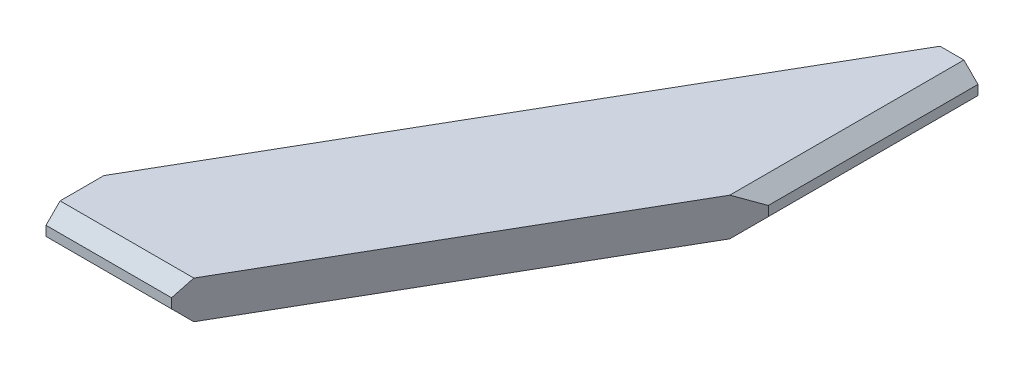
ISO-10303-21;
HEADER;
FILE_DESCRIPTION(('STEP AP214'),'2;1');
FILE_NAME('part.step','',(''),(''),'','','');
FILE_SCHEMA(('AUTOMOTIVE_DESIGN { 1 0 10303 214 1 1 1 1 }'));
ENDSEC;
DATA;
#1=APPLICATION_CONTEXT('core data for automotive mechanical design processes');
#2=APPLICATION_PROTOCOL_DEFINITION('international standard','automotive_design',2000,#1);
#3=PRODUCT_CONTEXT('',#1,'mechanical');
#4=PRODUCT('Part','Part','',(#3));
#5=PRODUCT_RELATED_PRODUCT_CATEGORY('part','',(#4));
#6=PRODUCT_DEFINITION_FORMATION('','',#4);
#7=PRODUCT_DEFINITION_CONTEXT('part definition',#1,'design');
#8=PRODUCT_DEFINITION('design','',#6,#7);
#9=PRODUCT_DEFINITION_SHAPE('','',#8);
#10=(LENGTH_UNIT() NAMED_UNIT(*) SI_UNIT(.MILLI.,.METRE.));
#11=(NAMED_UNIT(*) PLANE_ANGLE_UNIT() SI_UNIT($,.RADIAN.));
#12=(NAMED_UNIT(*) SI_UNIT($,.STERADIAN.) SOLID_ANGLE_UNIT());
#13=UNCERTAINTY_MEASURE_WITH_UNIT(LENGTH_MEASURE(1.E-05),#10,'distance_accuracy_value','');
#14=(GEOMETRIC_REPRESENTATION_CONTEXT(3) GLOBAL_UNCERTAINTY_ASSIGNED_CONTEXT((#13)) GLOBAL_UNIT_ASSIGNED_CONTEXT((#10,
#11,#12)) REPRESENTATION_CONTEXT('',''));
#15=CARTESIAN_POINT('',(0.,0.,0.));
#16=DIRECTION('',(0.,0.,1.));
#17=DIRECTION('',(1.,0.,0.));
#18=AXIS2_PLACEMENT_3D('',#15,#16,#17);
#19=CARTESIAN_POINT('',(-178.835248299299,17.4625,236.147347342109));
#20=DIRECTION('',(1.,0.,0.));
#21=DIRECTION('',(0.,0.,-1.));
#22=AXIS2_PLACEMENT_3D('',#19,#20,#21);
#23=PLANE('',#22);
#24=DIRECTION('',(0.,0.,1.));
#25=VECTOR('',#24,1.);
#26=CARTESIAN_POINT('',(-178.835248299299,-17.4625,236.147347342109));
#27=LINE('',#26,#25);
#28=CARTESIAN_POINT('',(-178.835248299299,-17.4625,182.751736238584));
#29=VERTEX_POINT('',#28);
#30=CARTESIAN_POINT('',(-178.835248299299,-17.4625,223.147347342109));
#31=VERTEX_POINT('',#30);
#32=EDGE_CURVE('E156',#29,#31,#27,.T.);
#33=ORIENTED_EDGE('',*,*,#32,.T.);
#34=DIRECTION('',(0.,0.707106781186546,0.707106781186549));
#35=VECTOR('',#34,1.);
#36=CARTESIAN_POINT('',(-178.835248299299,-4.46249999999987,236.147347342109));
#37=LINE('',#36,#35);
#38=CARTESIAN_POINT('',(-178.835248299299,-4.46249999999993,236.147347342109));
#39=VERTEX_POINT('',#38);
#40=EDGE_CURVE('E67',#31,#39,#37,.T.);
#41=ORIENTED_EDGE('',*,*,#40,.T.);
#42=DIRECTION('',(0.,-1.,0.));
#43=VECTOR('',#42,1.);
#44=CARTESIAN_POINT('',(-178.835248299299,17.4625,236.147347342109));
#45=LINE('',#44,#43);
#46=CARTESIAN_POINT('',(-178.835248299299,4.46249999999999,236.147347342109));
#47=VERTEX_POINT('',#46);
#48=EDGE_CURVE('E181',#47,#39,#45,.T.);
#49=ORIENTED_EDGE('',*,*,#48,.F.);
#50=DIRECTION('',(0.,-0.707106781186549,0.707106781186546));
#51=VECTOR('',#50,1.);
#52=CARTESIAN_POINT('',(-178.835248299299,17.4624999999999,223.147347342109));
#53=LINE('',#52,#51);
#54=CARTESIAN_POINT('',(-178.835248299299,17.4625,223.147347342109));
#55=VERTEX_POINT('',#54);
#56=EDGE_CURVE('E64',#47,#55,#53,.F.);
#57=ORIENTED_EDGE('',*,*,#56,.T.);
#58=DIRECTION('',(0.,0.,1.));
#59=VECTOR('',#58,1.);
#60=CARTESIAN_POINT('',(-178.835248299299,17.4625,236.147347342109));
#61=LINE('',#60,#59);
#62=CARTESIAN_POINT('',(-178.835248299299,17.4625,182.751736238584));
#63=VERTEX_POINT('',#62);
#64=EDGE_CURVE('E169',#63,#55,#61,.T.);
#65=ORIENTED_EDGE('',*,*,#64,.F.);
#66=DIRECTION('',(0.,-1.,0.));
#67=VECTOR('',#66,1.);
#68=CARTESIAN_POINT('',(-178.835248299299,17.4625,182.751736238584));
#69=LINE('',#68,#67);
#70=EDGE_CURVE('E149',#63,#29,#69,.T.);
#71=ORIENTED_EDGE('',*,*,#70,.T.);
#72=EDGE_LOOP('',(#33,#41,#49,#57,#65,#71));
#73=FACE_BOUND('',#72,.T.);
#74=ADVANCED_FACE('F46',(#73),#23,.F.);
#75=CARTESIAN_POINT('',(-63.0162503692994,17.4625,236.147347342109));
#76=DIRECTION('',(0.,0.,-1.));
#77=DIRECTION('',(-1.,0.,0.));
#78=AXIS2_PLACEMENT_3D('',#75,#76,#77);
#79=PLANE('',#78);
#80=ORIENTED_EDGE('',*,*,#48,.T.);
#81=DIRECTION('',(1.,0.,0.));
#82=VECTOR('',#81,1.);
#83=CARTESIAN_POINT('',(-63.0162503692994,-4.46249999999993,236.147347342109));
#84=LINE('',#83,#82);
#85=CARTESIAN_POINT('',(-63.0162503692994,-4.46249999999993,236.147347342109));
#86=VERTEX_POINT('',#85);
#87=EDGE_CURVE('E216',#39,#86,#84,.T.);
#88=ORIENTED_EDGE('',*,*,#87,.T.);
#89=DIRECTION('',(0.,-1.,0.));
#90=VECTOR('',#89,1.);
#91=CARTESIAN_POINT('',(-63.0162503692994,17.4625,236.147347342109));
#92=LINE('',#91,#90);
#93=CARTESIAN_POINT('',(-63.0162503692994,4.46249999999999,236.147347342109));
#94=VERTEX_POINT('',#93);
#95=EDGE_CURVE('E180',#94,#86,#92,.T.);
#96=ORIENTED_EDGE('',*,*,#95,.F.);
#97=DIRECTION('',(-1.,0.,0.));
#98=VECTOR('',#97,1.);
#99=CARTESIAN_POINT('',(-63.0162503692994,4.46249999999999,236.147347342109));
#100=LINE('',#99,#98);
#101=EDGE_CURVE('E213',#94,#47,#100,.T.);
#102=ORIENTED_EDGE('',*,*,#101,.T.);
#103=EDGE_LOOP('',(#80,#88,#96,#102));
#104=FACE_BOUND('',#103,.T.);
#105=ADVANCED_FACE('F259',(#104),#79,.F.);
#106=CARTESIAN_POINT('',(-63.0162503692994,17.4625,236.147347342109));
#107=DIRECTION('',(-0.86602540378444,0.,-0.499999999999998));
#108=DIRECTION('',(-0.499999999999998,0.,0.86602540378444));
#109=AXIS2_PLACEMENT_3D('',#106,#107,#108);
#110=PLANE('',#109);
#111=DIRECTION('',(0.499999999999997,0.,-0.86602540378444));
#112=VECTOR('',#111,1.);
#113=CARTESIAN_POINT('',(-63.0162503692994,-17.4625,236.147347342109));
#114=LINE('',#113,#112);
#115=CARTESIAN_POINT('',(-55.5106968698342,-17.4625,223.147347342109));
#116=VERTEX_POINT('',#115);
#117=CARTESIAN_POINT('',(125.425749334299,-17.4625,-90.2437704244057));
#118=VERTEX_POINT('',#117);
#119=EDGE_CURVE('E163',#116,#118,#114,.T.);
#120=ORIENTED_EDGE('',*,*,#119,.T.);
#121=DIRECTION('',(0.447213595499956,0.447213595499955,-0.774596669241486));
#122=VECTOR('',#121,1.);
#123=CARTESIAN_POINT('',(205.413930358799,62.5256810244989,-228.787363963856));
#124=LINE('',#123,#122);
#125=CARTESIAN_POINT('',(138.425749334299,-4.46249999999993,-112.760430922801));
#126=VERTEX_POINT('',#125);
#127=EDGE_CURVE('E215',#118,#126,#124,.T.);
#128=ORIENTED_EDGE('',*,*,#127,.T.);
#129=DIRECTION('',(0.,-1.,0.));
#130=VECTOR('',#129,1.);
#131=CARTESIAN_POINT('',(138.425749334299,17.4625,-112.760430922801));
#132=LINE('',#131,#130);
#133=CARTESIAN_POINT('',(138.425749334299,4.46249999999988,-112.760430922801));
#134=VERTEX_POINT('',#133);
#135=EDGE_CURVE('E173',#134,#126,#132,.T.);
#136=ORIENTED_EDGE('',*,*,#135,.F.);
#137=DIRECTION('',(0.447213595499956,-0.447213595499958,-0.774596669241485));
#138=VECTOR('',#137,1.);
#139=CARTESIAN_POINT('',(94.164390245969,48.7238590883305,-36.0975081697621));
#140=LINE('',#139,#138);
#141=CARTESIAN_POINT('',(125.425749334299,17.4625,-90.2437704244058));
#142=VERTEX_POINT('',#141);
#143=EDGE_CURVE('E207',#134,#142,#140,.F.);
#144=ORIENTED_EDGE('',*,*,#143,.T.);
#145=DIRECTION('',(0.499999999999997,0.,-0.86602540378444));
#146=VECTOR('',#145,1.);
#147=CARTESIAN_POINT('',(-63.0162503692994,17.4625,236.147347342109));
#148=LINE('',#147,#146);
#149=CARTESIAN_POINT('',(-55.5106968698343,17.4625,223.147347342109));
#150=VERTEX_POINT('',#149);
#151=EDGE_CURVE('E138',#150,#142,#148,.T.);
#152=ORIENTED_EDGE('',*,*,#151,.F.);
#153=DIRECTION('',(0.377964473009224,0.654653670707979,-0.654653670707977));
#154=VECTOR('',#153,1.);
#155=CARTESIAN_POINT('',(-47.580597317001,31.1978353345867,209.412012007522));
#156=LINE('',#155,#154);
#157=EDGE_CURVE('E201',#150,#94,#156,.F.);
#158=ORIENTED_EDGE('',*,*,#157,.T.);
#159=ORIENTED_EDGE('',*,*,#95,.T.);
#160=DIRECTION('',(0.377964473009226,-0.654653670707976,-0.654653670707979));
#161=VECTOR('',#160,1.);
#162=CARTESIAN_POINT('',(-63.0162503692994,-4.46249999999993,236.147347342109));
#163=LINE('',#162,#161);
#164=EDGE_CURVE('E209',#86,#116,#163,.T.);
#165=ORIENTED_EDGE('',*,*,#164,.T.);
#166=EDGE_LOOP('',(#120,#128,#136,#144,#152,#158,#159,#165));
#167=FACE_BOUND('',#166,.T.);
#168=ADVANCED_FACE('F233',(#167),#110,.F.);
#169=CARTESIAN_POINT('',(138.425749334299,17.4625,-306.138652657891));
#170=DIRECTION('',(-1.,0.,0.));
#171=DIRECTION('',(0.,0.,1.));
#172=AXIS2_PLACEMENT_3D('',#169,#170,#171);
#173=PLANE('',#172);
#174=ORIENTED_EDGE('',*,*,#135,.T.);
#175=DIRECTION('',(0.,0.,-1.));
#176=VECTOR('',#175,1.);
#177=CARTESIAN_POINT('',(138.425749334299,-4.46249999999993,-306.138652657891));
#178=LINE('',#177,#176);
#179=CARTESIAN_POINT('',(138.425749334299,-4.46249999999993,-306.138652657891));
#180=VERTEX_POINT('',#179);
#181=EDGE_CURVE('E190',#126,#180,#178,.T.);
#182=ORIENTED_EDGE('',*,*,#181,.T.);
#183=DIRECTION('',(0.,-1.,0.));
#184=VECTOR('',#183,1.);
#185=CARTESIAN_POINT('',(138.425749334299,17.4625,-306.138652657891));
#186=LINE('',#185,#184);
#187=CARTESIAN_POINT('',(138.425749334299,4.46249999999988,-306.138652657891));
#188=VERTEX_POINT('',#187);
#189=EDGE_CURVE('E150',#188,#180,#186,.T.);
#190=ORIENTED_EDGE('',*,*,#189,.F.);
#191=DIRECTION('',(0.,0.,1.));
#192=VECTOR('',#191,1.);
#193=CARTESIAN_POINT('',(138.425749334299,4.46249999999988,-306.138652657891));
#194=LINE('',#193,#192);
#195=EDGE_CURVE('E183',#188,#134,#194,.T.);
#196=ORIENTED_EDGE('',*,*,#195,.T.);
#197=EDGE_LOOP('',(#174,#182,#190,#196));
#198=FACE_BOUND('',#197,.T.);
#199=ADVANCED_FACE('F243',(#198),#173,.F.);
#200=CARTESIAN_POINT('',(103.425749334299,17.4625,-306.138652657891));
#201=DIRECTION('',(0.,0.,1.));
#202=DIRECTION('',(1.,0.,0.));
#203=AXIS2_PLACEMENT_3D('',#200,#201,#202);
#204=PLANE('',#203);
#205=ORIENTED_EDGE('',*,*,#189,.T.);
#206=DIRECTION('',(-0.707106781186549,-0.707106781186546,0.));
#207=VECTOR('',#206,1.);
#208=CARTESIAN_POINT('',(138.425749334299,-4.46249999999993,-306.138652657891));
#209=LINE('',#208,#207);
#210=CARTESIAN_POINT('',(125.425749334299,-17.4625,-306.138652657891));
#211=VERTEX_POINT('',#210);
#212=EDGE_CURVE('E191',#180,#211,#209,.T.);
#213=ORIENTED_EDGE('',*,*,#212,.T.);
#214=DIRECTION('',(-1.,0.,0.));
#215=VECTOR('',#214,1.);
#216=CARTESIAN_POINT('',(103.425749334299,-17.4625,-306.138652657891));
#217=LINE('',#216,#215);
#218=CARTESIAN_POINT('',(103.425749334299,-17.4625,-306.138652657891));
#219=VERTEX_POINT('',#218);
#220=EDGE_CURVE('E141',#211,#219,#217,.T.);
#221=ORIENTED_EDGE('',*,*,#220,.T.);
#222=DIRECTION('',(0.,-1.,0.));
#223=VECTOR('',#222,1.);
#224=CARTESIAN_POINT('',(103.425749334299,17.4625,-306.138652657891));
#225=LINE('',#224,#223);
#226=CARTESIAN_POINT('',(103.425749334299,17.4625,-306.138652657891));
#227=VERTEX_POINT('',#226);
#228=EDGE_CURVE('E139',#227,#219,#225,.T.);
#229=ORIENTED_EDGE('',*,*,#228,.F.);
#230=DIRECTION('',(-1.,0.,0.));
#231=VECTOR('',#230,1.);
#232=CARTESIAN_POINT('',(103.425749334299,17.4625,-306.138652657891));
#233=LINE('',#232,#231);
#234=CARTESIAN_POINT('',(125.425749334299,17.4625,-306.138652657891));
#235=VERTEX_POINT('',#234);
#236=EDGE_CURVE('E127',#235,#227,#233,.T.);
#237=ORIENTED_EDGE('',*,*,#236,.F.);
#238=DIRECTION('',(-0.707106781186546,0.707106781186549,0.));
#239=VECTOR('',#238,1.);
#240=CARTESIAN_POINT('',(125.4257493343,17.4624999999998,-306.138652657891));
#241=LINE('',#240,#239);
#242=EDGE_CURVE('E192',#235,#188,#241,.F.);
#243=ORIENTED_EDGE('',*,*,#242,.T.);
#244=EDGE_LOOP('',(#205,#213,#221,#229,#237,#243));
#245=FACE_BOUND('',#244,.T.);
#246=ADVANCED_FACE('F142',(#245),#204,.F.);
#247=CARTESIAN_POINT('',(-178.835248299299,17.4625,182.751736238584));
#248=DIRECTION('',(0.86602540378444,0.,0.499999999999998));
#249=DIRECTION('',(0.499999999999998,0.,-0.86602540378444));
#250=AXIS2_PLACEMENT_3D('',#247,#248,#249);
#251=PLANE('',#250);
#252=DIRECTION('',(-0.499999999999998,0.,0.86602540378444));
#253=VECTOR('',#252,1.);
#254=CARTESIAN_POINT('',(-178.835248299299,-17.4625,182.751736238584));
#255=LINE('',#254,#253);
#256=EDGE_CURVE('E170',#219,#29,#255,.T.);
#257=ORIENTED_EDGE('',*,*,#256,.T.);
#258=ORIENTED_EDGE('',*,*,#70,.F.);
#259=DIRECTION('',(-0.499999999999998,0.,0.86602540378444));
#260=VECTOR('',#259,1.);
#261=CARTESIAN_POINT('',(-178.835248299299,17.4625,182.751736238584));
#262=LINE('',#261,#260);
#263=EDGE_CURVE('E133',#227,#63,#262,.T.);
#264=ORIENTED_EDGE('',*,*,#263,.F.);
#265=ORIENTED_EDGE('',*,*,#228,.T.);
#266=EDGE_LOOP('',(#257,#258,#264,#265));
#267=FACE_BOUND('',#266,.T.);
#268=ADVANCED_FACE('F148',(#267),#251,.F.);
#269=CARTESIAN_POINT('',(0.,17.4625,0.));
#270=DIRECTION('',(0.,-1.,0.));
#271=DIRECTION('',(0.,0.,-1.));
#272=AXIS2_PLACEMENT_3D('',#269,#270,#271);
#273=PLANE('',#272);
#274=ORIENTED_EDGE('',*,*,#151,.T.);
#275=DIRECTION('',(0.,0.,-1.));
#276=VECTOR('',#275,1.);
#277=CARTESIAN_POINT('',(125.425749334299,17.4625,0.));
#278=LINE('',#277,#276);
#279=EDGE_CURVE('E11',#142,#235,#278,.T.);
#280=ORIENTED_EDGE('',*,*,#279,.T.);
#281=ORIENTED_EDGE('',*,*,#236,.T.);
#282=ORIENTED_EDGE('',*,*,#263,.T.);
#283=ORIENTED_EDGE('',*,*,#64,.T.);
#284=DIRECTION('',(1.,0.,0.));
#285=VECTOR('',#284,1.);
#286=CARTESIAN_POINT('',(-1.06952800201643E-13,17.4625,223.147347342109));
#287=LINE('',#286,#285);
#288=EDGE_CURVE('E57',#55,#150,#287,.T.);
#289=ORIENTED_EDGE('',*,*,#288,.T.);
#290=EDGE_LOOP('',(#274,#280,#281,#282,#283,#289));
#291=FACE_BOUND('',#290,.T.);
#292=ADVANCED_FACE('F126',(#291),#273,.F.);
#293=CARTESIAN_POINT('',(0.,-17.4625,0.));
#294=DIRECTION('',(0.,-1.,0.));
#295=DIRECTION('',(0.,0.,-1.));
#296=AXIS2_PLACEMENT_3D('',#293,#294,#295);
#297=PLANE('',#296);
#298=ORIENTED_EDGE('',*,*,#220,.F.);
#299=DIRECTION('',(0.,0.,1.));
#300=VECTOR('',#299,1.);
#301=CARTESIAN_POINT('',(125.425749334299,-17.4625,-112.760430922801));
#302=LINE('',#301,#300);
#303=EDGE_CURVE('E199',#211,#118,#302,.T.);
#304=ORIENTED_EDGE('',*,*,#303,.T.);
#305=ORIENTED_EDGE('',*,*,#119,.F.);
#306=DIRECTION('',(-1.,0.,0.));
#307=VECTOR('',#306,1.);
#308=CARTESIAN_POINT('',(-178.835248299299,-17.4625,223.147347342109));
#309=LINE('',#308,#307);
#310=EDGE_CURVE('E200',#116,#31,#309,.T.);
#311=ORIENTED_EDGE('',*,*,#310,.T.);
#312=ORIENTED_EDGE('',*,*,#32,.F.);
#313=ORIENTED_EDGE('',*,*,#256,.F.);
#314=EDGE_LOOP('',(#298,#304,#305,#311,#312,#313));
#315=FACE_BOUND('',#314,.T.);
#316=ADVANCED_FACE('F249',(#315),#297,.T.);
#317=CARTESIAN_POINT('',(138.425749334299,-4.46249999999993,-306.138652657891));
#318=DIRECTION('',(0.707106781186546,-0.707106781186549,0.));
#319=DIRECTION('',(0.,0.,1.));
#320=AXIS2_PLACEMENT_3D('',#317,#318,#319);
#321=PLANE('',#320);
#322=ORIENTED_EDGE('',*,*,#127,.F.);
#323=ORIENTED_EDGE('',*,*,#303,.F.);
#324=ORIENTED_EDGE('',*,*,#212,.F.);
#325=ORIENTED_EDGE('',*,*,#181,.F.);
#326=EDGE_LOOP('',(#322,#323,#324,#325));
#327=FACE_BOUND('',#326,.T.);
#328=ADVANCED_FACE('F250',(#327),#321,.T.);
#329=CARTESIAN_POINT('',(-63.0162503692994,-4.46249999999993,236.147347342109));
#330=DIRECTION('',(0.,-0.707106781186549,0.707106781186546));
#331=DIRECTION('',(-1.,0.,0.));
#332=AXIS2_PLACEMENT_3D('',#329,#330,#331);
#333=PLANE('',#332);
#334=ORIENTED_EDGE('',*,*,#40,.F.);
#335=ORIENTED_EDGE('',*,*,#310,.F.);
#336=ORIENTED_EDGE('',*,*,#164,.F.);
#337=ORIENTED_EDGE('',*,*,#87,.F.);
#338=EDGE_LOOP('',(#334,#335,#336,#337));
#339=FACE_BOUND('',#338,.T.);
#340=ADVANCED_FACE('F257',(#339),#333,.T.);
#341=CARTESIAN_POINT('',(125.425749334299,17.4625,0.));
#342=DIRECTION('',(-0.707106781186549,-0.707106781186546,0.));
#343=DIRECTION('',(0.,0.,-1.));
#344=AXIS2_PLACEMENT_3D('',#341,#342,#343);
#345=PLANE('',#344);
#346=ORIENTED_EDGE('',*,*,#143,.F.);
#347=ORIENTED_EDGE('',*,*,#195,.F.);
#348=ORIENTED_EDGE('',*,*,#242,.F.);
#349=ORIENTED_EDGE('',*,*,#279,.F.);
#350=EDGE_LOOP('',(#346,#347,#348,#349));
#351=FACE_BOUND('',#350,.T.);
#352=ADVANCED_FACE('F239',(#351),#345,.F.);
#353=CARTESIAN_POINT('',(-1.06952800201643E-13,17.4625,223.147347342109));
#354=DIRECTION('',(0.,-0.707106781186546,-0.707106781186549));
#355=DIRECTION('',(1.,0.,0.));
#356=AXIS2_PLACEMENT_3D('',#353,#354,#355);
#357=PLANE('',#356);
#358=ORIENTED_EDGE('',*,*,#56,.F.);
#359=ORIENTED_EDGE('',*,*,#101,.F.);
#360=ORIENTED_EDGE('',*,*,#157,.F.);
#361=ORIENTED_EDGE('',*,*,#288,.F.);
#362=EDGE_LOOP('',(#358,#359,#360,#361));
#363=FACE_BOUND('',#362,.T.);
#364=ADVANCED_FACE('F47',(#363),#357,.F.);
#365=CLOSED_SHELL('',(#74,#105,#168,#199,#246,#268,#292,#316,#328,#340,#352,#364));
#366=MANIFOLD_SOLID_BREP('B2',#365);
#367=ADVANCED_BREP_SHAPE_REPRESENTATION('',(#18,#366),#14);
#368=SHAPE_DEFINITION_REPRESENTATION(#9,#367);
ENDSEC;
END-ISO-10303-21;
